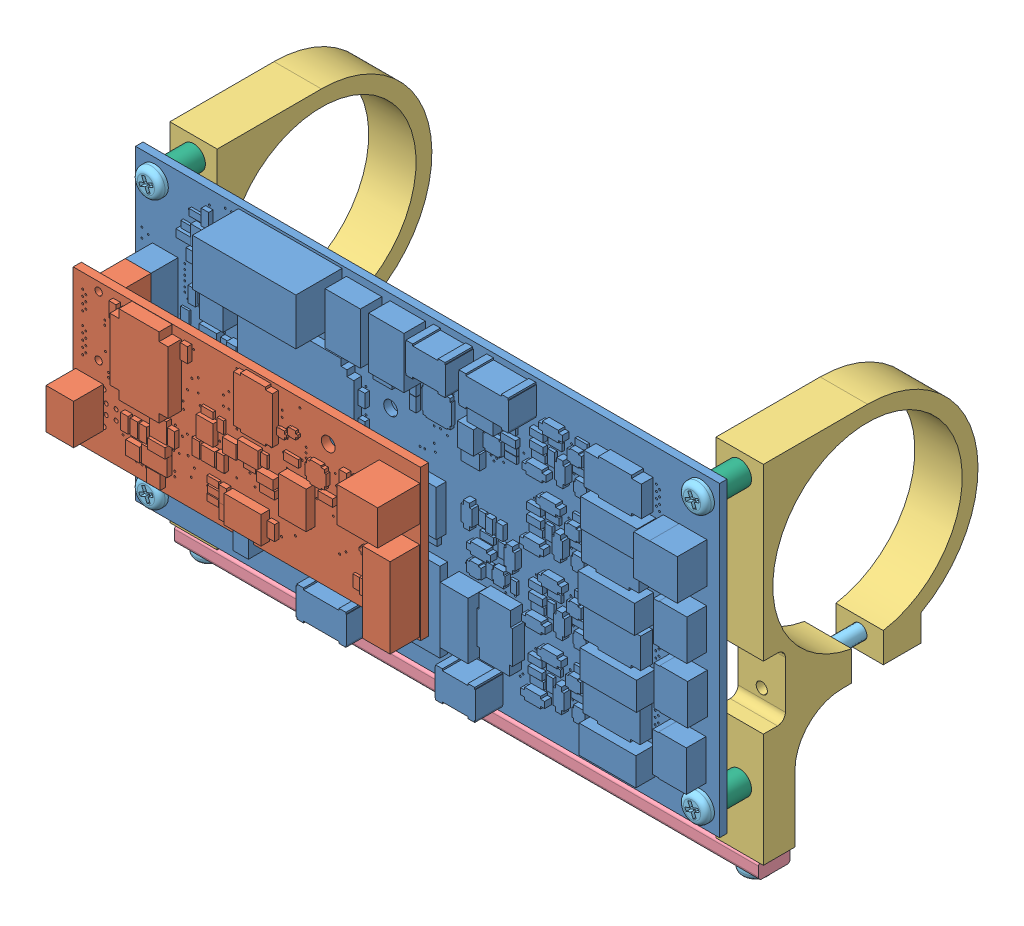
SolidWorks assembly PCBaasy.SLDASM, configuration OnBrackets (file format 15000). Lengths in mm.
Overall size (119.38 74.88 72.11).
18 component instances, 6 part files, 21 mates.
Components (placement in the parent):
- BCBaasy-mPhox+pH-1: BCBaasy-mPhox+pH.SLDASM [Default] at origin size (117.47 61.72 33.12)
  - 100221415ra_mphox_Solid-1: 100221415ra_mphox_Solid.SLDPRT [Default] at origin size (117.47 61.72 25.67)
  - 100221250ra_mcap-1: 100221250ra_mcap.SLDPRT [Default] at (0 10.414 12.4054) size (69.85 30.23 15.62)
- LoggerMount-1: LoggerMount.SLDPRT [Default] at (3.81 33.02 -27.305) x (0 -1 0) z (-1 0 0) size (69.85 43.18 9.53)
- LoggerMount-2: LoggerMount.SLDPRT [Default] at (113.665 33.02 -27.305) x (0 -1 0) z (-1 0 0) size (69.85 43.18 9.53)
- 4490T173_Architectural 6063 Aluminum Bar-1: 4490T173_Architectural 6063 Aluminum Bar.SLDPRT [4490T173] at (58.7375 -16.1925 -9.525) x (0 0 1) z (-1 0 0) size (6.35 3.17 117.47)
- Pan Head Phillips (U.S.)-1: Pan Head Phillips (U.S.).SLDPRT [[264]  4 -40 UNC x ½] at (3.81 -2.54 1.5037) x (-0.923728 -0.383049 0) z (0 0 -1) size (5.56 5.56 14.43)
- Pan Head Phillips (U.S.)-2: Pan Head Phillips (U.S.).SLDPRT [[264]  4 -40 UNC x ½] at (3.81 51.435 1.5037) x (-0.923728 -0.383049 0) z (0 0 -1) size (5.56 5.56 14.43)
- Pan Head Phillips (U.S.)-3: Pan Head Phillips (U.S.).SLDPRT [[268]  4 -40 UNC x 1] at (3.81 11.684 -38.1) size (5.56 5.56 27.13)
- Pan Head Phillips (U.S.)-4: Pan Head Phillips (U.S.).SLDPRT [[264]  4 -40 UNC x ½] at (3.81 -17.78 -9.525) x (1 0 0) z (0 1 0) size (5.56 5.56 14.43)
- 94639A706_Off-White Nylon Unthreaded Spacer-1: 94639A706_Off-White Nylon Unthreaded Spacer.SLDPRT [94639A706] at (3.81 -2.54 -3.175) size (4.76 4.76 6.35)
- 94639A706_Off-White Nylon Unthreaded Spacer-2: 94639A706_Off-White Nylon Unthreaded Spacer.SLDPRT [94639A706] at (3.81 51.435 -3.175) size (4.76 4.76 6.35)
- Pan Head Phillips (U.S.)-9: Pan Head Phillips (U.S.).SLDPRT [[264]  4 -40 UNC x ½] at (113.665 51.435 1.5037) x (-0.923728 -0.383049 0) z (0 0 -1) size (5.56 5.56 14.43)
- Pan Head Phillips (U.S.)-10: Pan Head Phillips (U.S.).SLDPRT [[264]  4 -40 UNC x ½] at (113.665 -17.78 -9.525) x (1 0 0) z (0 1 0) size (5.56 5.56 14.43)
- 94639A706_Off-White Nylon Unthreaded Spacer-3: 94639A706_Off-White Nylon Unthreaded Spacer.SLDPRT [94639A706] at (113.665 51.435 -3.175) size (4.76 4.76 6.35)
- 94639A706_Off-White Nylon Unthreaded Spacer-4: 94639A706_Off-White Nylon Unthreaded Spacer.SLDPRT [94639A706] at (113.665 -2.54 -3.175) size (4.76 4.76 6.35)
- Pan Head Phillips (U.S.)-11: Pan Head Phillips (U.S.).SLDPRT [[268]  4 -40 UNC x 1] at (113.665 11.684 -38.1) size (5.56 5.56 27.13)
- Pan Head Phillips (U.S.)-12: Pan Head Phillips (U.S.).SLDPRT [[264]  4 -40 UNC x ½] at (113.665 -2.54 1.5037) x (-0.923728 -0.383049 0) z (0 0 -1) size (5.56 5.56 14.43)
Mates (geometry in assembly coordinates):
- Distance1: distance = 3.175 mm anti-aligned: plane of 9008K761_Multipurpose 6061 Aluminum-1 through (-0.635 54.61 -3.175) normal (0 0 1); plane of BCBaasy-mPhox+pH-1/100221415ra_mphox_Solid-1 through (0 0 0) normal (0 0 -1)
- Concentric1: concentric aligned: cylinder of BCBaasy-mPhox+pH-1/100221415ra_mphox_Solid-1 through (3.81 51.435 1.5037) axis (0 0 -1) radius 1.6002; cylinder of 9008K761_Multipurpose 6061 Aluminum-1 through (3.81 51.435 -3.175) axis (0 0 -1) radius 1.1303
- Concentric2: concentric aligned: cylinder of BCBaasy-mPhox+pH-1/100221415ra_mphox_Solid-1 through (113.665 51.435 1.5037) axis (0 0 -1) radius 1.6002; cylinder of 9008K761_Multipurpose 6061 Aluminum-1 through (113.665 51.435 -3.175) axis (0 0 -1) radius 1.1303
- Concentric4: concentric anti-aligned: cylinder of BCBaasy-mPhox+pH-1/100221415ra_mphox_Solid-1 through (3.81 -2.54 1.5037) axis (0 0 -1) radius 1.6002; cylinder of LoggerMount-1 through (3.81 -2.54 -27.94) axis (0 0 1) radius 1.1303
- Concentric5: concentric anti-aligned: cylinder of BCBaasy-mPhox+pH-1/100221415ra_mphox_Solid-1 through (3.81 51.435 1.5037) axis (0 0 -1) radius 1.6002; cylinder of LoggerMount-1 through (3.81 51.435 -27.94) axis (0 0 1) radius 1.1303
- Distance2: distance = 6.35 mm anti-aligned: plane of BCBaasy-mPhox+pH-1/100221415ra_mphox_Solid-1 through (0 0 0) normal (0 0 -1); plane of LoggerMount-1 through (-0.9525 55.245 -6.35) normal (0 0 1)
- Concentric6: concentric anti-aligned: cylinder of LoggerMount-1 through (3.81 -1.905 -9.525) axis (0 -1 0) radius 1.1303; cylinder of 4490T173_Architectural 6063 Aluminum Bar-1 through (3.81 -17.78 -9.525) axis (0 1 0) radius 1.6383
- Coincident3: coincident anti-aligned: plane of LoggerMount-2 through (108.9025 -14.605 -6.35) normal (0 -1 0); plane of 4490T173_Architectural 6063 Aluminum Bar-1 through (0 -14.605 -6.985) normal (0 1 0)
- Concentric7: concentric anti-aligned: cylinder of LoggerMount-2 through (113.665 -1.905 -9.525) axis (0 -1 0) radius 1.1303; cylinder of 4490T173_Architectural 6063 Aluminum Bar-1 through (113.665 -17.78 -9.525) axis (0 1 0) radius 1.6383
- Coincident4: coincident anti-aligned: plane of BCBaasy-mPhox+pH-1/100221415ra_mphox_Solid-1 through (0 0 1.5037) normal (0 0 1); plane of Pan Head Phillips (U.S.)-1 through (1.2408 -3.6054 1.5037) normal (0 0 -1)
- Concentric8: concentric anti-aligned: cylinder of BCBaasy-mPhox+pH-1/100221415ra_mphox_Solid-1 through (3.81 -2.54 1.5037) axis (0 0 -1) radius 1.6002; cylinder of Pan Head Phillips (U.S.)-1 through (3.81 -2.54 -11.1963) axis (0 0 1) radius 1.4224
- Coincident5: coincident anti-aligned: plane of BCBaasy-mPhox+pH-1/100221415ra_mphox_Solid-1 through (0 0 1.5037) normal (0 0 1); plane of Pan Head Phillips (U.S.)-2 through (1.2408 50.3696 1.5037) normal (0 0 -1)
- Concentric9: concentric anti-aligned: cylinder of BCBaasy-mPhox+pH-1/100221415ra_mphox_Solid-1 through (3.81 51.435 1.5037) axis (0 0 -1) radius 1.6002; cylinder of Pan Head Phillips (U.S.)-2 through (3.81 51.435 -11.1963) axis (0 0 1) radius 1.4224
- Coincident6: coincident anti-aligned: plane of LoggerMount-1 through (-0.9525 8.255 -38.1) normal (0 0 -1); plane of Pan Head Phillips (U.S.)-3 through (6.5913 11.684 -38.1) normal (0 0 1)
- Concentric10: concentric aligned: cylinder of LoggerMount-1 through (3.81 11.684 -6.349) axis (0 0 -1) radius 1.4732; cylinder of Pan Head Phillips (U.S.)-3 through (3.81 11.684 -12.7) axis (0 0 -1) radius 1.4224
- Coincident7: coincident anti-aligned: plane of 4490T173_Architectural 6063 Aluminum Bar-1 through (0 -17.78 -6.985) normal (0 -1 0); plane of Pan Head Phillips (U.S.)-4 through (6.5913 -17.78 -9.525) normal (0 1 0)
- Concentric11: concentric anti-aligned: cylinder of 4490T173_Architectural 6063 Aluminum Bar-1 through (3.81 -17.78 -9.525) axis (0 1 0) radius 1.6383; cylinder of Pan Head Phillips (U.S.)-4 through (3.81 -5.08 -9.525) axis (0 -1 0) radius 1.4224
- Coincident8: coincident anti-aligned: plane of LoggerMount-1 through (-0.9525 8.255 -6.35) normal (0 0 1); plane of 94639A706_Off-White Nylon Unthreaded Spacer-1 through (3.81 -2.54 -6.35) normal (0 0 -1)
- Concentric12: concentric anti-aligned: cylinder of Pan Head Phillips (U.S.)-1 through (3.81 -2.54 -11.1963) axis (0 0 1) radius 1.4224; cylinder of 94639A706_Off-White Nylon Unthreaded Spacer-1 through (3.81 -2.54 0) axis (0 0 -1) radius 2.3813
- Coincident9: coincident anti-aligned: plane of LoggerMount-1 through (-0.9525 55.245 -6.35) normal (0 0 1); plane of 94639A706_Off-White Nylon Unthreaded Spacer-2 through (3.81 51.435 -6.35) normal (0 0 -1)
- Concentric13: concentric anti-aligned: cylinder of Pan Head Phillips (U.S.)-2 through (3.81 51.435 -11.1963) axis (0 0 1) radius 1.4224; cylinder of 94639A706_Off-White Nylon Unthreaded Spacer-2 through (3.81 51.435 0) axis (0 0 -1) radius 2.3813
